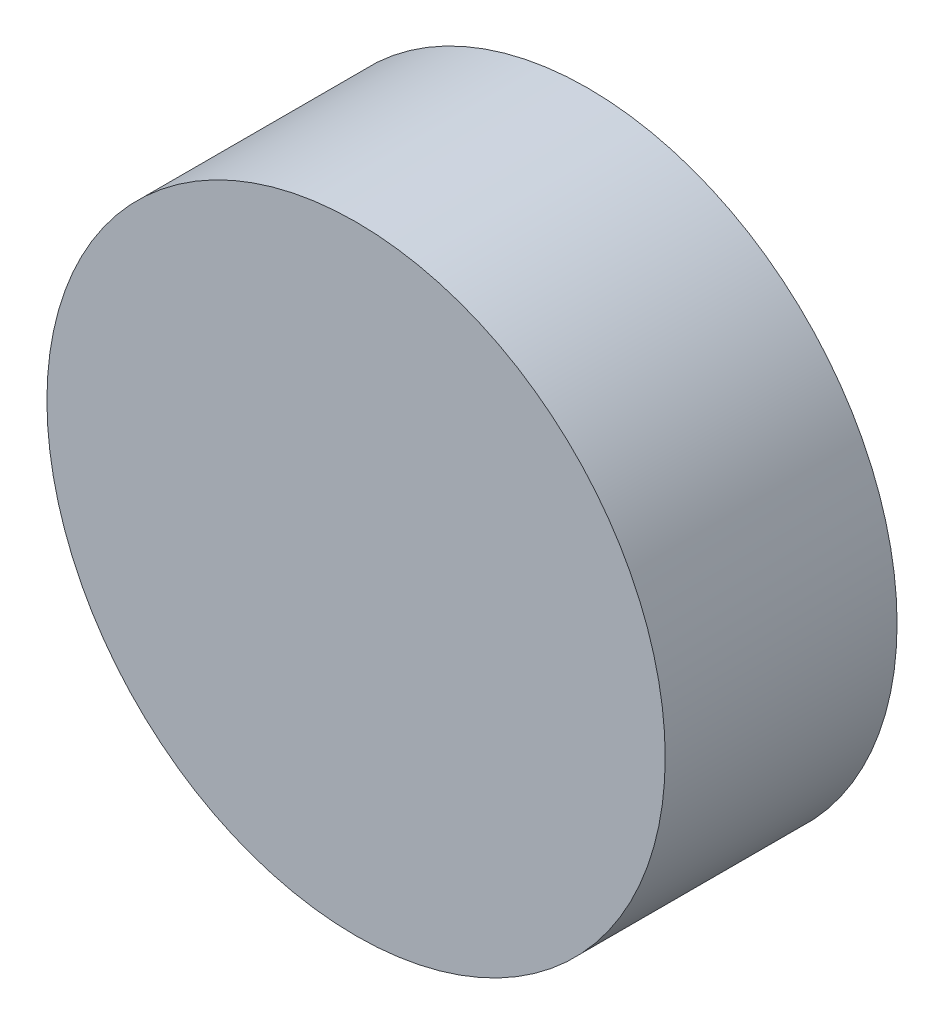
ISO-10303-21;
HEADER;
FILE_DESCRIPTION(('STEP AP214'),'2;1');
FILE_NAME('part.step','',(''),(''),'','','');
FILE_SCHEMA(('AUTOMOTIVE_DESIGN { 1 0 10303 214 1 1 1 1 }'));
ENDSEC;
DATA;
#1=APPLICATION_CONTEXT('core data for automotive mechanical design processes');
#2=APPLICATION_PROTOCOL_DEFINITION('international standard','automotive_design',2000,#1);
#3=PRODUCT_CONTEXT('',#1,'mechanical');
#4=PRODUCT('Part','Part','',(#3));
#5=PRODUCT_RELATED_PRODUCT_CATEGORY('part','',(#4));
#6=PRODUCT_DEFINITION_FORMATION('','',#4);
#7=PRODUCT_DEFINITION_CONTEXT('part definition',#1,'design');
#8=PRODUCT_DEFINITION('design','',#6,#7);
#9=PRODUCT_DEFINITION_SHAPE('','',#8);
#10=(LENGTH_UNIT() NAMED_UNIT(*) SI_UNIT(.MILLI.,.METRE.));
#11=(NAMED_UNIT(*) PLANE_ANGLE_UNIT() SI_UNIT($,.RADIAN.));
#12=(NAMED_UNIT(*) SI_UNIT($,.STERADIAN.) SOLID_ANGLE_UNIT());
#13=UNCERTAINTY_MEASURE_WITH_UNIT(LENGTH_MEASURE(1.E-05),#10,'distance_accuracy_value','');
#14=(GEOMETRIC_REPRESENTATION_CONTEXT(3) GLOBAL_UNCERTAINTY_ASSIGNED_CONTEXT((#13)) GLOBAL_UNIT_ASSIGNED_CONTEXT((#10,
#11,#12)) REPRESENTATION_CONTEXT('',''));
#15=CARTESIAN_POINT('',(0.,0.,0.));
#16=DIRECTION('',(0.,0.,1.));
#17=DIRECTION('',(1.,0.,0.));
#18=AXIS2_PLACEMENT_3D('',#15,#16,#17);
#19=CARTESIAN_POINT('',(0.,0.,0.));
#20=DIRECTION('',(0.,0.,1.));
#21=DIRECTION('',(1.,0.,0.));
#22=AXIS2_PLACEMENT_3D('',#19,#20,#21);
#23=PLANE('',#22);
#24=CARTESIAN_POINT('',(0.,0.,0.));
#25=DIRECTION('',(0.,0.,-1.));
#26=DIRECTION('',(-1.,0.,0.));
#27=AXIS2_PLACEMENT_3D('',#24,#25,#26);
#28=CIRCLE('',#27,5.08);
#29=CARTESIAN_POINT('',(-5.08,0.,0.));
#30=VERTEX_POINT('',#29);
#31=EDGE_CURVE('E72',#30,#30,#28,.T.);
#32=ORIENTED_EDGE('',*,*,#31,.F.);
#33=EDGE_LOOP('',(#32));
#34=FACE_BOUND('',#33,.T.);
#35=CARTESIAN_POINT('',(0.,0.,0.));
#36=DIRECTION('',(0.,0.,1.));
#37=DIRECTION('',(1.,0.,0.));
#38=AXIS2_PLACEMENT_3D('',#35,#36,#37);
#39=CIRCLE('',#38,101.6);
#40=CARTESIAN_POINT('',(-101.6,0.,0.));
#41=VERTEX_POINT('',#40);
#42=EDGE_CURVE('E11',#41,#41,#39,.T.);
#43=ORIENTED_EDGE('',*,*,#42,.F.);
#44=EDGE_LOOP('',(#43));
#45=FACE_BOUND('',#44,.T.);
#46=ADVANCED_FACE('F46',(#34,#45),#23,.F.);
#47=CARTESIAN_POINT('',(0.,0.,76.2));
#48=DIRECTION('',(0.,0.,1.));
#49=DIRECTION('',(1.,0.,0.));
#50=AXIS2_PLACEMENT_3D('',#47,#48,#49);
#51=PLANE('',#50);
#52=CARTESIAN_POINT('',(0.,0.,76.2));
#53=DIRECTION('',(0.,0.,1.));
#54=DIRECTION('',(1.,0.,0.));
#55=AXIS2_PLACEMENT_3D('',#52,#53,#54);
#56=CIRCLE('',#55,101.6);
#57=CARTESIAN_POINT('',(-101.6,0.,76.2));
#58=VERTEX_POINT('',#57);
#59=EDGE_CURVE('E63',#58,#58,#56,.T.);
#60=ORIENTED_EDGE('',*,*,#59,.T.);
#61=EDGE_LOOP('',(#60));
#62=FACE_BOUND('',#61,.T.);
#63=ADVANCED_FACE('F67',(#62),#51,.T.);
#64=CARTESIAN_POINT('',(0.,0.,0.));
#65=DIRECTION('',(0.,0.,1.));
#66=DIRECTION('',(1.,0.,0.));
#67=AXIS2_PLACEMENT_3D('',#64,#65,#66);
#68=CYLINDRICAL_SURFACE('',#67,101.6);
#69=ORIENTED_EDGE('',*,*,#59,.F.);
#70=DIRECTION('',(0.,0.,-1.));
#71=VECTOR('',#70,1.);
#72=CARTESIAN_POINT('',(-101.6,0.,0.));
#73=LINE('',#72,#71);
#74=EDGE_CURVE('E55',#58,#41,#73,.T.);
#75=ORIENTED_EDGE('',*,*,#74,.T.);
#76=ORIENTED_EDGE('',*,*,#42,.T.);
#77=ORIENTED_EDGE('',*,*,#74,.F.);
#78=EDGE_LOOP('',(#69,#75,#76,#77));
#79=FACE_BOUND('',#78,.T.);
#80=ADVANCED_FACE('F62',(#79),#68,.T.);
#81=CARTESIAN_POINT('',(0.,0.,5.08));
#82=DIRECTION('',(0.,0.,-1.));
#83=DIRECTION('',(-1.,0.,0.));
#84=AXIS2_PLACEMENT_3D('',#81,#82,#83);
#85=CYLINDRICAL_SURFACE('',#84,5.08);
#86=CARTESIAN_POINT('',(0.,0.,5.08));
#87=DIRECTION('',(0.,0.,-1.));
#88=DIRECTION('',(-1.,0.,0.));
#89=AXIS2_PLACEMENT_3D('',#86,#87,#88);
#90=CIRCLE('',#89,5.08);
#91=CARTESIAN_POINT('',(-5.08,0.,5.08));
#92=VERTEX_POINT('',#91);
#93=EDGE_CURVE('E69',#92,#92,#90,.T.);
#94=ORIENTED_EDGE('',*,*,#93,.F.);
#95=EDGE_LOOP('',(#94));
#96=FACE_BOUND('',#95,.T.);
#97=ORIENTED_EDGE('',*,*,#31,.T.);
#98=EDGE_LOOP('',(#97));
#99=FACE_BOUND('',#98,.T.);
#100=ADVANCED_FACE('F79',(#96,#99),#85,.F.);
#101=CARTESIAN_POINT('',(0.,0.,5.08));
#102=DIRECTION('',(0.,0.,-1.));
#103=DIRECTION('',(-1.,0.,0.));
#104=AXIS2_PLACEMENT_3D('',#101,#102,#103);
#105=PLANE('',#104);
#106=ORIENTED_EDGE('',*,*,#93,.T.);
#107=EDGE_LOOP('',(#106));
#108=FACE_BOUND('',#107,.T.);
#109=ADVANCED_FACE('F93',(#108),#105,.T.);
#110=CLOSED_SHELL('',(#46,#63,#80,#100,#109));
#111=MANIFOLD_SOLID_BREP('B2',#110);
#112=ADVANCED_BREP_SHAPE_REPRESENTATION('',(#18,#111),#14);
#113=SHAPE_DEFINITION_REPRESENTATION(#9,#112);
ENDSEC;
END-ISO-10303-21;
